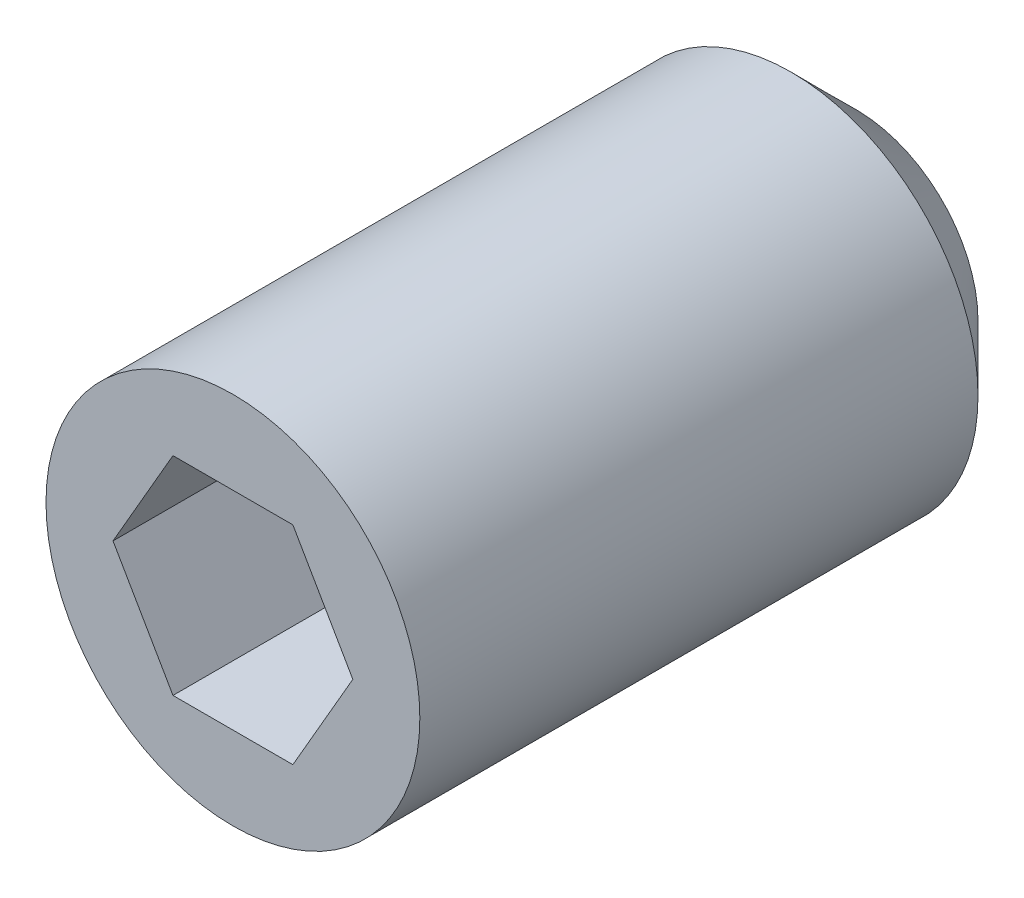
from build123d import *

# Parameters (mm, degrees)
SKETCH1_R      = 1.143
CYLINDER_DEPTH = 3.81
HEX_2_DEPTH    = 1.5875
CHAMFER1_SIZE  = 0.396875


with BuildPart() as part:
    # Sketch1 → cylinder (new body)
    with BuildSketch(Plane.XY):
        with Locations(Location((0, 0, 0), (0, 0, 180))):
            Circle(SKETCH1_R)
    extrude(amount=CYLINDER_DEPTH)

    # Hexagon - circumscribed1 → hex 2 (cut)
    with BuildSketch(Plane(origin=(0.056837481, 0.066692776, 3.81), x_dir=(1, 0, 0), z_dir=(0, 0, 1))):
        Polygon((-0.423454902, 0.568307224), (0.30977994, 0.568307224), (0.676397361, -0.066692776), (0.30977994, -0.701692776), (-0.423454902, -0.701692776), (-0.790072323, -0.066692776), align=None)
    extrude(amount=-HEX_2_DEPTH, mode=Mode.SUBTRACT)

    # Chamfer1
    chamfer1_edges = [part.edges().sort_by_distance(p)[0] for p in [
        (1.143, 0, 0),
    ]]
    chamfer(chamfer1_edges, length=CHAMFER1_SIZE)


solid = part.part
